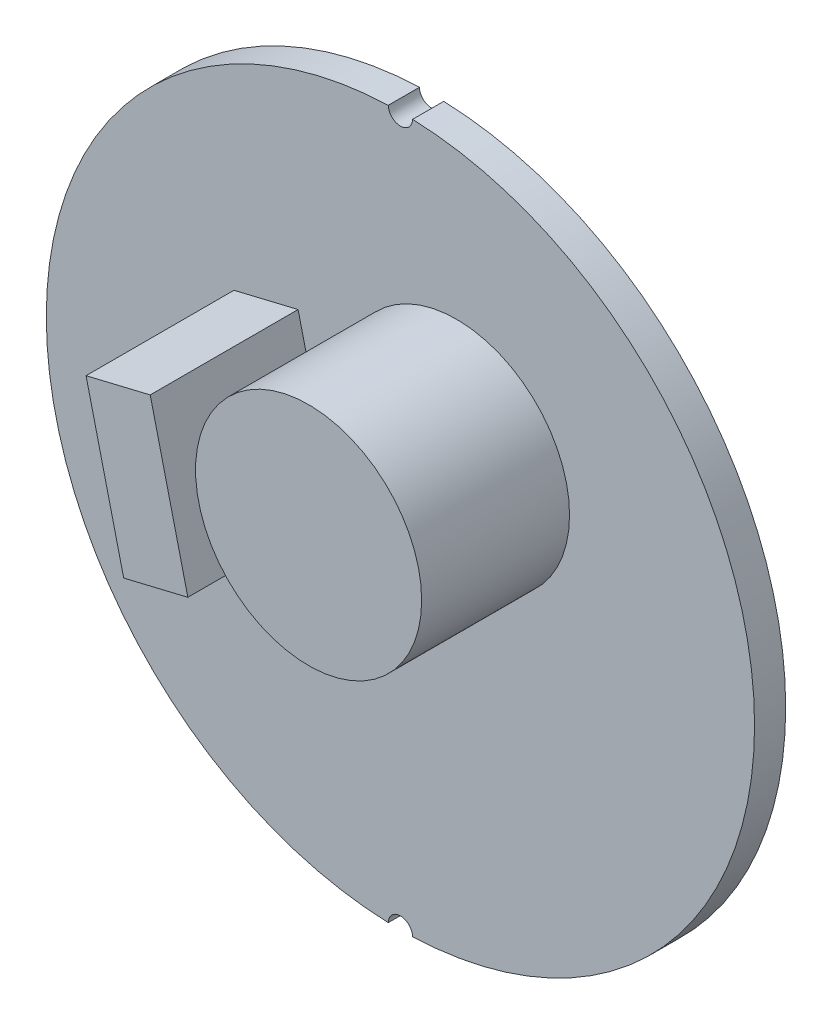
from build123d import *

# Parameters (mm, degrees)
SKETCH1_R           = 23.114
BOSS_EXTRUDE1_DEPTH = 2.032
SKETCH2_R           = 7.379454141
BOSS_EXTRUDE3_DEPTH = 9.652
SKETCH3_R           = 0.79375
CUT_EXTRUDE1_DEPTH  = 9.652


with BuildPart() as part:
    # Sketch1 → Boss-Extrude1 (new body)
    with BuildSketch(Plane.XY):
        Circle(SKETCH1_R)
    extrude(amount=BOSS_EXTRUDE1_DEPTH)

    # Sketch2 → Boss-Extrude3 (add)
    with BuildSketch(Plane.XY.offset(2.032)):
        with Locations((3.657507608, 5.857312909)):
            Circle(SKETCH2_R)
        Polygon((-10.866508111, 7.606555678), (-6.678926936, 8.613695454), (-4.223013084, -1.597735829), (-8.410594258, -2.604875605), align=None)
    extrude(amount=BOSS_EXTRUDE3_DEPTH)

    # Sketch3 → Cut-Extrude1 (cut)
    with BuildSketch(Plane.XY.offset(2.032)):
        with Locations((0, 23.114)):
            Circle(SKETCH3_R)
        with Locations((0, -23.114)):
            Circle(SKETCH3_R)
    extrude(amount=-CUT_EXTRUDE1_DEPTH, mode=Mode.SUBTRACT)


solid = part.part
